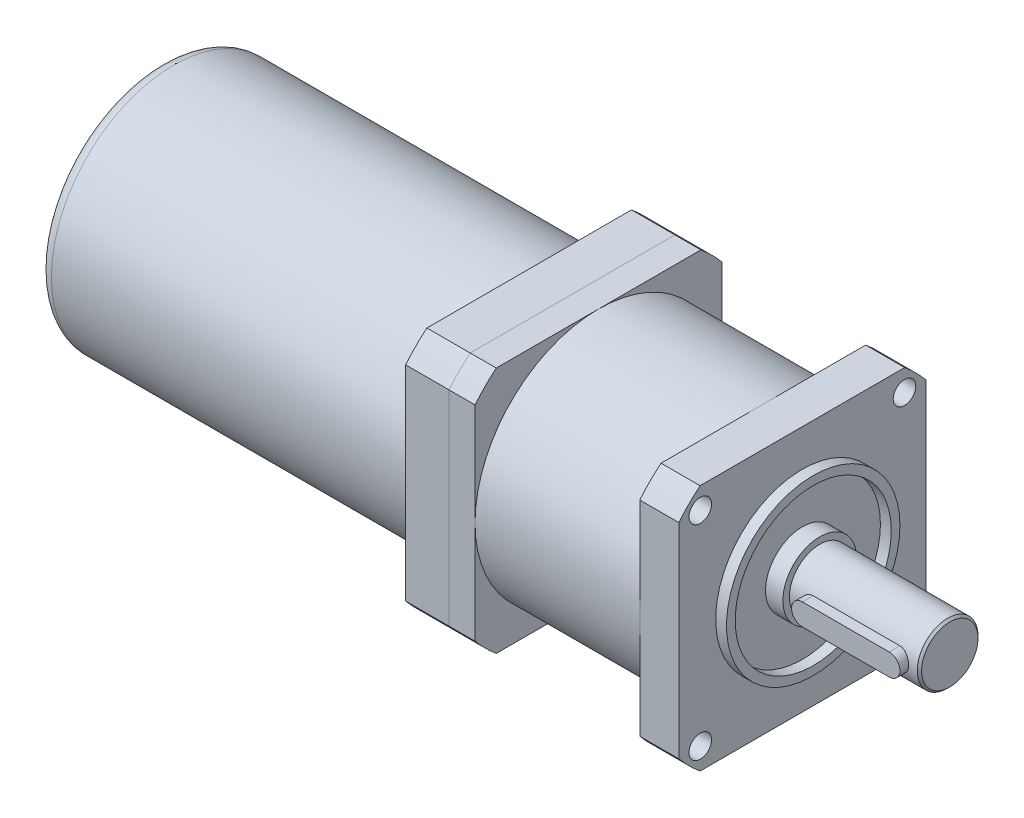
from build123d import *

# Parameters (mm, degrees)
EXTRUDE_1_DEPTH     = 9
SKETCH_2_R          = 28.5
EXTRUDE_2_DEPTH     = 38
EXTRUDE_3_DEPTH     = 6
SKETCH_6_R          = 2.6
CUT_EXTRUDE_2_DEPTH = 9
SKETCH_7_R          = 20
SKETCH_7_R_2        = 18
EXTRUDE_5_DEPTH     = 2.5
SKETCH_8_R          = 8.5
EXTRUDE_6_DEPTH     = 4
SKETCH_9_R          = 7
EXTRUDE_7_DEPTH     = 30
CUT_EXTRUDE_3_DEPTH = 3
EXTRUDE_START       = 5
EXTRUDE_8_DEPTH     = 5
CHAMFER_1_SIZE      = 0.5
EXTRUDE_9_DEPTH     = 10
SKETCH_15_R         = 28.2
EXTRUDE_10_DEPTH    = 85
FILLET_1_R          = 3


with BuildPart() as part:
    # Sketch 1 → Extrude 1 (new body)
    with BuildSketch(Plane(origin=(0, 0, 0), x_dir=(0, 0, -1), z_dir=(1, 0, 0))):
        with BuildLine():
            Line((-23.595550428, -28.5), (23.595550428, -28.5))
            ThreePointArc((23.595550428, -28.5), (26.162950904, -26.162950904), (28.5, -23.595550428))
            Line((28.5, -23.595550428), (28.5, 23.595550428))
            ThreePointArc((28.5, 23.595550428), (26.162950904, 26.162950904), (23.595550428, 28.5))
            Line((23.595550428, 28.5), (-23.595550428, 28.5))
            ThreePointArc((-23.595550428, 28.5), (-26.162950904, 26.162950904), (-28.5, 23.595550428))
            Line((-28.5, 23.595550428), (-28.5, -23.595550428))
            ThreePointArc((-28.5, -23.595550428), (-26.162950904, -26.162950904), (-23.595550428, -28.5))
        make_face()
    extrude(amount=-EXTRUDE_1_DEPTH)

    # Sketch 2 → Extrude 2 (add)
    with BuildSketch(Plane.ZY.offset(9)):
        Circle(SKETCH_2_R)
    extrude(amount=EXTRUDE_2_DEPTH)

    # Sketch 3 → Extrude 3 (add)
    with BuildSketch(Plane.ZY.offset(47)):
        with BuildLine():
            Line((-23.595550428, -28.5), (23.595550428, -28.5))
            ThreePointArc((23.595550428, -28.5), (26.162950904, -26.162950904), (28.5, -23.595550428))
            Line((28.5, -23.595550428), (28.5, 23.595550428))
            ThreePointArc((28.5, 23.595550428), (26.162950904, 26.162950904), (23.595550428, 28.5))
            Line((23.595550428, 28.5), (-23.595550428, 28.5))
            ThreePointArc((-23.595550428, 28.5), (-26.162950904, 26.162950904), (-28.5, 23.595550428))
            Line((-28.5, 23.595550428), (-28.5, -23.595550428))
            ThreePointArc((-28.5, -23.595550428), (-26.162950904, -26.162950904), (-23.595550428, -28.5))
        make_face()
    extrude(amount=EXTRUDE_3_DEPTH)

    # Sketch 6 → Cut-Extrude 2 (cut)
    with BuildSketch(Plane(origin=(0, 0, 0), x_dir=(0, 0, -1), z_dir=(1, 0, 0))):
        with Locations((-23.55, 23.55)):
            Circle(SKETCH_6_R)
        with Locations((23.55, 23.55)):
            Circle(SKETCH_6_R)
        with Locations((23.55, -23.55)):
            Circle(SKETCH_6_R)
        with Locations((-23.55, -23.55)):
            Circle(SKETCH_6_R)
    extrude(amount=-CUT_EXTRUDE_2_DEPTH, mode=Mode.SUBTRACT)

    # Sketch 7 → Extrude 5 (add)
    with BuildSketch(Plane(origin=(0, 0, 0), x_dir=(0, 0, -1), z_dir=(1, 0, 0))):
        Circle(SKETCH_7_R)
        Circle(SKETCH_7_R_2, mode=Mode.SUBTRACT)
    extrude(amount=EXTRUDE_5_DEPTH)

    # Sketch 8 → Extrude 6 (add)
    with BuildSketch(Plane(origin=(0, 0, 0), x_dir=(0, 0, -1), z_dir=(1, 0, 0))):
        Circle(SKETCH_8_R)
    extrude(amount=EXTRUDE_6_DEPTH)

    # Sketch 9 → Extrude 7 (add)
    with BuildSketch(Plane(origin=(4, 0, 0), x_dir=(0, 0, -1), z_dir=(1, 0, 0))):
        Circle(SKETCH_9_R)
    extrude(amount=EXTRUDE_7_DEPTH)

    # Sketch 10 → Cut-Extrude 3 (cut)
    with BuildSketch(Plane.XY.offset(7)):
        with BuildLine():
            Line((9, 2.5), (29, 2.5))
            ThreePointArc((29, 2.5), (31.5, 0), (29, -2.5))
            Line((29, -2.5), (9, -2.5))
            ThreePointArc((9, -2.5), (6.5, 0), (9, 2.5))
        make_face()
    extrude(amount=-CUT_EXTRUDE_3_DEPTH, mode=Mode.SUBTRACT)

    # Sketch 11 → Extrude 8 (add)
    with BuildSketch(Plane.XY.offset(4).offset(EXTRUDE_START)):
        with BuildLine():
            Line((9, 2.5), (29, 2.5))
            ThreePointArc((29, 2.5), (31.5, 0), (29, -2.5))
            Line((29, -2.5), (9, -2.5))
            ThreePointArc((9, -2.5), (6.5, 0), (9, 2.5))
        make_face()
    extrude(amount=-EXTRUDE_8_DEPTH)

    # Chamfer 1
    chamfer_1_edges = [part.edges().sort_by_distance(p)[0] for p in [
        (34, 0, 7),
    ]]
    chamfer(chamfer_1_edges, length=CHAMFER_1_SIZE)


with BuildPart() as body_2:
    # Sketch 14 → Extrude 9 (new body)
    with BuildSketch(Plane.ZY.offset(53)):
        with BuildLine():
            Line((-23.595550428, -28.5), (23.595550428, -28.5))
            ThreePointArc((23.595550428, -28.5), (26.162950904, -26.162950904), (28.5, -23.595550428))
            Line((28.5, -23.595550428), (28.5, 23.595550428))
            ThreePointArc((28.5, 23.595550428), (26.162950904, 26.162950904), (23.595550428, 28.5))
            Line((23.595550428, 28.5), (-23.595550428, 28.5))
            ThreePointArc((-23.595550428, 28.5), (-26.162950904, 26.162950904), (-28.5, 23.595550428))
            Line((-28.5, 23.595550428), (-28.5, -23.595550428))
            ThreePointArc((-28.5, -23.595550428), (-26.162950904, -26.162950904), (-23.595550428, -28.5))
        make_face()
    extrude(amount=EXTRUDE_9_DEPTH)

    # Sketch 15 → Extrude 10 (add)
    with BuildSketch(Plane.ZY.offset(63)):
        Circle(SKETCH_15_R)
    extrude(amount=EXTRUDE_10_DEPTH)

    # Fillet 1
    fillet_1_edges = [body_2.edges().sort_by_distance(p)[0] for p in [
        (-148, 0, -28.2),
    ]]
    fillet(fillet_1_edges, radius=FILLET_1_R)


solid = Compound([part.part, body_2.part])
